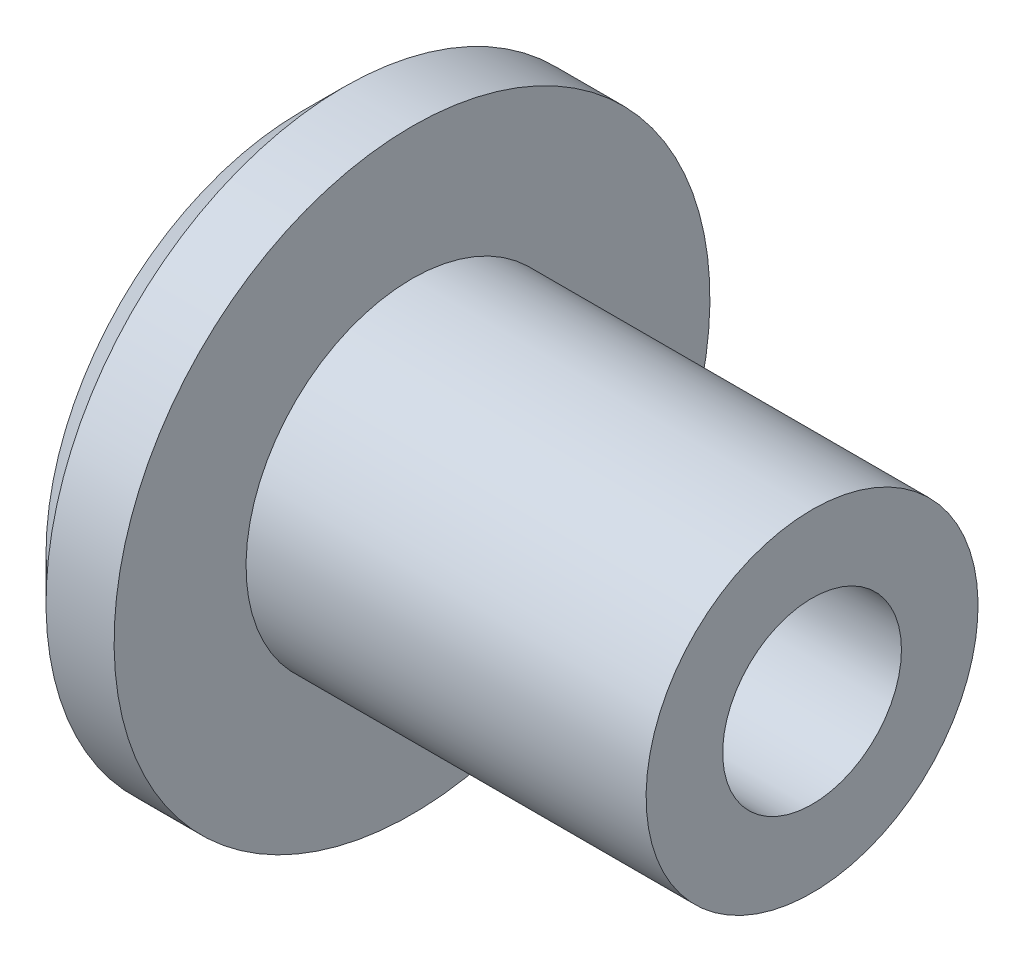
from build123d import *

# Parameters (mm, degrees)
M5_TAPPED_HOLE1_D = 4.2


with BuildPart() as part:
    # Sketch1 → Revolve1 (revolve)
    with BuildSketch(Plane.XY):
        Polygon((0, 0), (0, 6), (1, 7), (2.6, 7), (2.6, 3.9), (12, 3.9), (12, 0), align=None)
    revolve(axis=Axis((12, 0, 0), (-1, 0, 0)))

    # M5 Tapped Hole1 (through all)
    with Locations(Plane.YZ.offset(12)):
        with Locations((0, 0)):
            Hole(M5_TAPPED_HOLE1_D / 2)


solid = part.part
